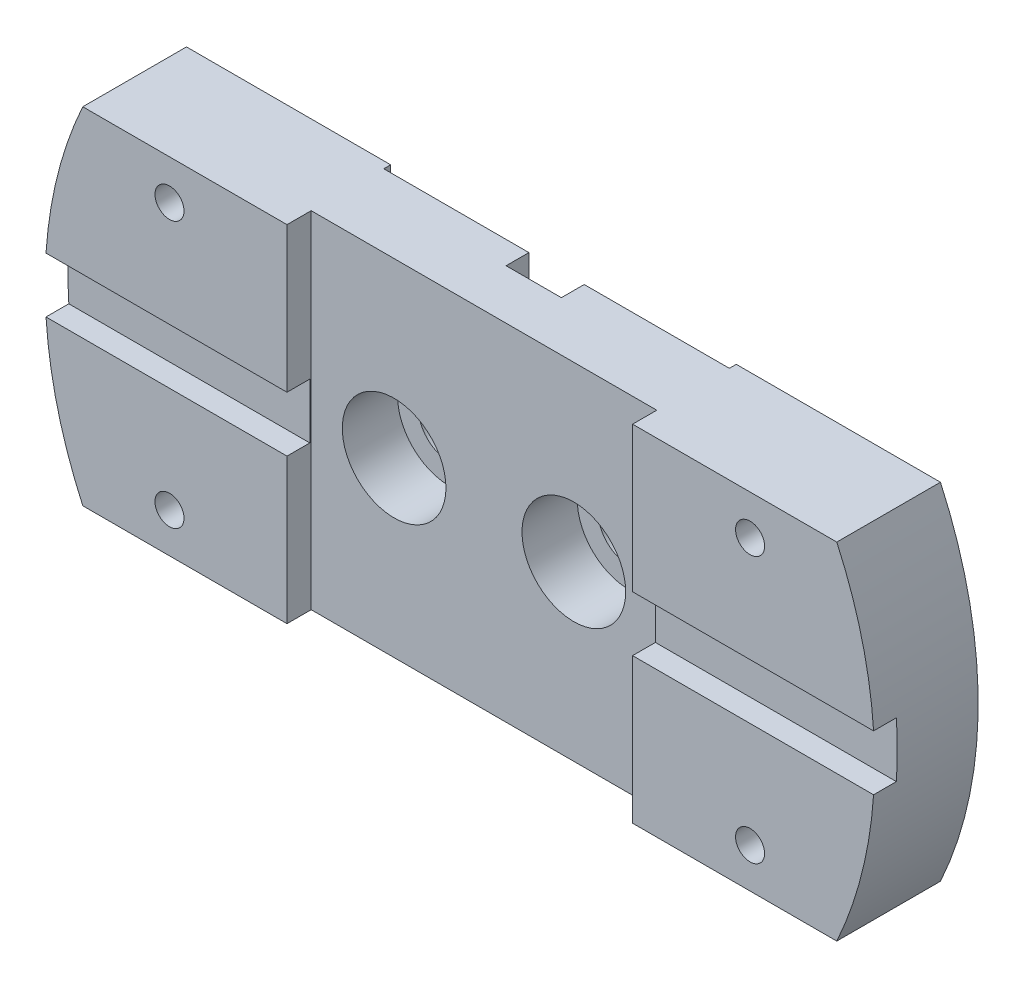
ISO-10303-21;
HEADER;
FILE_DESCRIPTION(('STEP AP214'),'2;1');
FILE_NAME('part.step','',(''),(''),'','','');
FILE_SCHEMA(('AUTOMOTIVE_DESIGN { 1 0 10303 214 1 1 1 1 }'));
ENDSEC;
DATA;
#1=APPLICATION_CONTEXT('core data for automotive mechanical design processes');
#2=APPLICATION_PROTOCOL_DEFINITION('international standard','automotive_design',2000,#1);
#3=PRODUCT_CONTEXT('',#1,'mechanical');
#4=PRODUCT('Part','Part','',(#3));
#5=PRODUCT_RELATED_PRODUCT_CATEGORY('part','',(#4));
#6=PRODUCT_DEFINITION_FORMATION('','',#4);
#7=PRODUCT_DEFINITION_CONTEXT('part definition',#1,'design');
#8=PRODUCT_DEFINITION('design','',#6,#7);
#9=PRODUCT_DEFINITION_SHAPE('','',#8);
#10=(LENGTH_UNIT() NAMED_UNIT(*) SI_UNIT(.MILLI.,.METRE.));
#11=(NAMED_UNIT(*) PLANE_ANGLE_UNIT() SI_UNIT($,.RADIAN.));
#12=(NAMED_UNIT(*) SI_UNIT($,.STERADIAN.) SOLID_ANGLE_UNIT());
#13=UNCERTAINTY_MEASURE_WITH_UNIT(LENGTH_MEASURE(1.E-05),#10,'distance_accuracy_value','');
#14=(GEOMETRIC_REPRESENTATION_CONTEXT(3) GLOBAL_UNCERTAINTY_ASSIGNED_CONTEXT((#13)) GLOBAL_UNIT_ASSIGNED_CONTEXT((#10,
#11,#12)) REPRESENTATION_CONTEXT('',''));
#15=CARTESIAN_POINT('',(0.,0.,0.));
#16=DIRECTION('',(0.,0.,1.));
#17=DIRECTION('',(1.,0.,0.));
#18=AXIS2_PLACEMENT_3D('',#15,#16,#17);
#19=CARTESIAN_POINT('',(0.,0.,15.));
#20=DIRECTION('',(0.,0.,1.));
#21=DIRECTION('',(1.,0.,0.));
#22=AXIS2_PLACEMENT_3D('',#19,#20,#21);
#23=PLANE('',#22);
#24=CARTESIAN_POINT('',(-42.,19.25,15.));
#25=DIRECTION('',(0.,0.,1.));
#26=DIRECTION('',(1.,0.,0.));
#27=AXIS2_PLACEMENT_3D('',#24,#25,#26);
#28=CIRCLE('',#27,2.09999999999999);
#29=CARTESIAN_POINT('',(-39.9,19.25,15.));
#30=VERTEX_POINT('',#29);
#31=EDGE_CURVE('E523',#30,#30,#28,.T.);
#32=ORIENTED_EDGE('',*,*,#31,.F.);
#33=EDGE_LOOP('',(#32));
#34=FACE_BOUND('',#33,.T.);
#35=DIRECTION('',(-1.,0.,0.));
#36=VECTOR('',#35,1.);
#37=CARTESIAN_POINT('',(0.,4.,15.));
#38=LINE('',#37,#36);
#39=CARTESIAN_POINT('',(-25.,4.,15.));
#40=VERTEX_POINT('',#39);
#41=CARTESIAN_POINT('',(-59.8665181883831,4.,15.));
#42=VERTEX_POINT('',#41);
#43=EDGE_CURVE('E232',#40,#42,#38,.T.);
#44=ORIENTED_EDGE('',*,*,#43,.F.);
#45=DIRECTION('',(0.,-1.,0.));
#46=VECTOR('',#45,1.);
#47=CARTESIAN_POINT('',(-25.,0.,15.));
#48=LINE('',#47,#46);
#49=CARTESIAN_POINT('',(-25.,25.,15.));
#50=VERTEX_POINT('',#49);
#51=EDGE_CURVE('E359',#50,#40,#48,.T.);
#52=ORIENTED_EDGE('',*,*,#51,.F.);
#53=DIRECTION('',(-1.,0.,0.));
#54=VECTOR('',#53,1.);
#55=CARTESIAN_POINT('',(-54.5435605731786,25.,15.));
#56=LINE('',#55,#54);
#57=CARTESIAN_POINT('',(-54.5435605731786,25.,15.));
#58=VERTEX_POINT('',#57);
#59=EDGE_CURVE('E324',#50,#58,#56,.T.);
#60=ORIENTED_EDGE('',*,*,#59,.T.);
#61=CARTESIAN_POINT('',(0.,0.,15.));
#62=DIRECTION('',(0.,0.,1.));
#63=DIRECTION('',(1.,0.,0.));
#64=AXIS2_PLACEMENT_3D('',#61,#62,#63);
#65=CIRCLE('',#64,60.);
#66=EDGE_CURVE('E313',#58,#42,#65,.T.);
#67=ORIENTED_EDGE('',*,*,#66,.T.);
#68=EDGE_LOOP('',(#44,#52,#60,#67));
#69=FACE_BOUND('',#68,.T.);
#70=ADVANCED_FACE('F32',(#34,#69),#23,.T.);
#71=CARTESIAN_POINT('',(42.,19.25,15.));
#72=DIRECTION('',(0.,0.,1.));
#73=DIRECTION('',(1.,0.,0.));
#74=AXIS2_PLACEMENT_3D('',#71,#72,#73);
#75=CIRCLE('',#74,2.09999999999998);
#76=CARTESIAN_POINT('',(44.1,19.25,15.));
#77=VERTEX_POINT('',#76);
#78=EDGE_CURVE('E529',#77,#77,#75,.T.);
#79=ORIENTED_EDGE('',*,*,#78,.F.);
#80=EDGE_LOOP('',(#79));
#81=FACE_BOUND('',#80,.T.);
#82=DIRECTION('',(-1.,0.,0.));
#83=VECTOR('',#82,1.);
#84=CARTESIAN_POINT('',(0.,4.,15.));
#85=LINE('',#84,#83);
#86=CARTESIAN_POINT('',(59.8665181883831,4.,15.));
#87=VERTEX_POINT('',#86);
#88=CARTESIAN_POINT('',(25.,4.,15.));
#89=VERTEX_POINT('',#88);
#90=EDGE_CURVE('E207',#87,#89,#85,.T.);
#91=ORIENTED_EDGE('',*,*,#90,.F.);
#92=CARTESIAN_POINT('',(0.,0.,15.));
#93=DIRECTION('',(0.,0.,1.));
#94=DIRECTION('',(1.,0.,0.));
#95=AXIS2_PLACEMENT_3D('',#92,#93,#94);
#96=CIRCLE('',#95,60.);
#97=CARTESIAN_POINT('',(54.5435605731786,25.,15.));
#98=VERTEX_POINT('',#97);
#99=EDGE_CURVE('E320',#87,#98,#96,.T.);
#100=ORIENTED_EDGE('',*,*,#99,.T.);
#101=CARTESIAN_POINT('',(25.,25.,15.));
#102=VERTEX_POINT('',#101);
#103=EDGE_CURVE('E325',#98,#102,#56,.T.);
#104=ORIENTED_EDGE('',*,*,#103,.T.);
#105=DIRECTION('',(0.,1.,0.));
#106=VECTOR('',#105,1.);
#107=CARTESIAN_POINT('',(25.,0.,15.));
#108=LINE('',#107,#106);
#109=EDGE_CURVE('E354',#89,#102,#108,.T.);
#110=ORIENTED_EDGE('',*,*,#109,.F.);
#111=EDGE_LOOP('',(#91,#100,#104,#110));
#112=FACE_BOUND('',#111,.T.);
#113=ADVANCED_FACE('F449',(#81,#112),#23,.T.);
#114=CARTESIAN_POINT('',(-42.,-19.25,15.));
#115=DIRECTION('',(0.,0.,1.));
#116=DIRECTION('',(1.,0.,0.));
#117=AXIS2_PLACEMENT_3D('',#114,#115,#116);
#118=CIRCLE('',#117,2.09999999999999);
#119=CARTESIAN_POINT('',(-39.9,-19.25,15.));
#120=VERTEX_POINT('',#119);
#121=EDGE_CURVE('E507',#120,#120,#118,.T.);
#122=ORIENTED_EDGE('',*,*,#121,.F.);
#123=EDGE_LOOP('',(#122));
#124=FACE_BOUND('',#123,.T.);
#125=DIRECTION('',(1.,0.,0.));
#126=VECTOR('',#125,1.);
#127=CARTESIAN_POINT('',(0.,-4.,15.));
#128=LINE('',#127,#126);
#129=CARTESIAN_POINT('',(-59.8665181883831,-4.,15.));
#130=VERTEX_POINT('',#129);
#131=CARTESIAN_POINT('',(-25.,-4.,15.));
#132=VERTEX_POINT('',#131);
#133=EDGE_CURVE('E49',#130,#132,#128,.T.);
#134=ORIENTED_EDGE('',*,*,#133,.F.);
#135=CARTESIAN_POINT('',(-54.5435605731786,-25.,15.));
#136=VERTEX_POINT('',#135);
#137=EDGE_CURVE('E217',#130,#136,#65,.T.);
#138=ORIENTED_EDGE('',*,*,#137,.T.);
#139=DIRECTION('',(1.,0.,0.));
#140=VECTOR('',#139,1.);
#141=CARTESIAN_POINT('',(-54.5435605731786,-25.,15.));
#142=LINE('',#141,#140);
#143=CARTESIAN_POINT('',(-25.,-25.,15.));
#144=VERTEX_POINT('',#143);
#145=EDGE_CURVE('E317',#136,#144,#142,.T.);
#146=ORIENTED_EDGE('',*,*,#145,.T.);
#147=EDGE_CURVE('E358',#132,#144,#48,.T.);
#148=ORIENTED_EDGE('',*,*,#147,.F.);
#149=EDGE_LOOP('',(#134,#138,#146,#148));
#150=FACE_BOUND('',#149,.T.);
#151=ADVANCED_FACE('F393',(#124,#150),#23,.T.);
#152=CARTESIAN_POINT('',(-25.,-25.,1.));
#153=DIRECTION('',(0.,0.,1.));
#154=DIRECTION('',(1.,0.,0.));
#155=AXIS2_PLACEMENT_3D('',#152,#153,#154);
#156=PLANE('',#155);
#157=CARTESIAN_POINT('',(13.,0.,1.));
#158=DIRECTION('',(0.,0.,1.));
#159=DIRECTION('',(1.,0.,0.));
#160=AXIS2_PLACEMENT_3D('',#157,#158,#159);
#161=CIRCLE('',#160,4.5);
#162=CARTESIAN_POINT('',(17.5,0.,1.));
#163=VERTEX_POINT('',#162);
#164=EDGE_CURVE('E36',#163,#163,#161,.T.);
#165=ORIENTED_EDGE('',*,*,#164,.T.);
#166=EDGE_LOOP('',(#165));
#167=FACE_BOUND('',#166,.T.);
#168=DIRECTION('',(1.,0.,0.));
#169=VECTOR('',#168,1.);
#170=CARTESIAN_POINT('',(-25.,-25.,1.));
#171=LINE('',#170,#169);
#172=CARTESIAN_POINT('',(4.,-25.,1.));
#173=VERTEX_POINT('',#172);
#174=CARTESIAN_POINT('',(25.,-25.,1.));
#175=VERTEX_POINT('',#174);
#176=EDGE_CURVE('E287',#173,#175,#171,.T.);
#177=ORIENTED_EDGE('',*,*,#176,.F.);
#178=DIRECTION('',(0.,1.,0.));
#179=VECTOR('',#178,1.);
#180=CARTESIAN_POINT('',(4.,-25.,1.));
#181=LINE('',#180,#179);
#182=CARTESIAN_POINT('',(4.,25.,1.));
#183=VERTEX_POINT('',#182);
#184=EDGE_CURVE('E349',#173,#183,#181,.T.);
#185=ORIENTED_EDGE('',*,*,#184,.T.);
#186=DIRECTION('',(1.,0.,0.));
#187=VECTOR('',#186,1.);
#188=CARTESIAN_POINT('',(-25.,25.,1.));
#189=LINE('',#188,#187);
#190=CARTESIAN_POINT('',(25.,25.,1.));
#191=VERTEX_POINT('',#190);
#192=EDGE_CURVE('E278',#183,#191,#189,.T.);
#193=ORIENTED_EDGE('',*,*,#192,.T.);
#194=DIRECTION('',(0.,1.,0.));
#195=VECTOR('',#194,1.);
#196=CARTESIAN_POINT('',(25.,-25.,1.));
#197=LINE('',#196,#195);
#198=EDGE_CURVE('E295',#175,#191,#197,.T.);
#199=ORIENTED_EDGE('',*,*,#198,.F.);
#200=EDGE_LOOP('',(#177,#185,#193,#199));
#201=FACE_BOUND('',#200,.T.);
#202=ADVANCED_FACE('F428',(#167,#201),#156,.F.);
#203=CARTESIAN_POINT('',(0.,0.,0.));
#204=DIRECTION('',(0.,0.,1.));
#205=DIRECTION('',(1.,0.,0.));
#206=AXIS2_PLACEMENT_3D('',#203,#204,#205);
#207=PLANE('',#206);
#208=CARTESIAN_POINT('',(-42.,-19.25,0.));
#209=DIRECTION('',(0.,0.,1.));
#210=DIRECTION('',(1.,0.,0.));
#211=AXIS2_PLACEMENT_3D('',#208,#209,#210);
#212=CIRCLE('',#211,2.1);
#213=CARTESIAN_POINT('',(-39.9,-19.25,0.));
#214=VERTEX_POINT('',#213);
#215=EDGE_CURVE('E510',#214,#214,#212,.T.);
#216=ORIENTED_EDGE('',*,*,#215,.T.);
#217=EDGE_LOOP('',(#216));
#218=FACE_BOUND('',#217,.T.);
#219=CARTESIAN_POINT('',(-42.,19.25,0.));
#220=DIRECTION('',(0.,0.,1.));
#221=DIRECTION('',(1.,0.,0.));
#222=AXIS2_PLACEMENT_3D('',#219,#220,#221);
#223=CIRCLE('',#222,2.1);
#224=CARTESIAN_POINT('',(-39.9,19.25,0.));
#225=VERTEX_POINT('',#224);
#226=EDGE_CURVE('E520',#225,#225,#223,.T.);
#227=ORIENTED_EDGE('',*,*,#226,.T.);
#228=EDGE_LOOP('',(#227));
#229=FACE_BOUND('',#228,.T.);
#230=DIRECTION('',(-1.,0.,0.));
#231=VECTOR('',#230,1.);
#232=CARTESIAN_POINT('',(-54.5435605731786,25.,0.));
#233=LINE('',#232,#231);
#234=CARTESIAN_POINT('',(-25.,25.,0.));
#235=VERTEX_POINT('',#234);
#236=CARTESIAN_POINT('',(-54.5435605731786,25.,0.));
#237=VERTEX_POINT('',#236);
#238=EDGE_CURVE('E309',#235,#237,#233,.T.);
#239=ORIENTED_EDGE('',*,*,#238,.F.);
#240=DIRECTION('',(0.,-1.,0.));
#241=VECTOR('',#240,1.);
#242=CARTESIAN_POINT('',(-25.,0.,0.));
#243=LINE('',#242,#241);
#244=CARTESIAN_POINT('',(-25.,-25.,0.));
#245=VERTEX_POINT('',#244);
#246=EDGE_CURVE('E343',#235,#245,#243,.T.);
#247=ORIENTED_EDGE('',*,*,#246,.T.);
#248=DIRECTION('',(1.,0.,0.));
#249=VECTOR('',#248,1.);
#250=CARTESIAN_POINT('',(-54.5435605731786,-25.,0.));
#251=LINE('',#250,#249);
#252=CARTESIAN_POINT('',(-54.5435605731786,-25.,0.));
#253=VERTEX_POINT('',#252);
#254=EDGE_CURVE('E304',#253,#245,#251,.T.);
#255=ORIENTED_EDGE('',*,*,#254,.F.);
#256=CARTESIAN_POINT('',(0.,0.,0.));
#257=DIRECTION('',(0.,0.,1.));
#258=DIRECTION('',(1.,0.,0.));
#259=AXIS2_PLACEMENT_3D('',#256,#257,#258);
#260=CIRCLE('',#259,60.);
#261=EDGE_CURVE('E298',#237,#253,#260,.T.);
#262=ORIENTED_EDGE('',*,*,#261,.F.);
#263=EDGE_LOOP('',(#239,#247,#255,#262));
#264=FACE_BOUND('',#263,.T.);
#265=ADVANCED_FACE('F403',(#218,#229,#264),#207,.F.);
#266=CARTESIAN_POINT('',(0.,0.,15.));
#267=DIRECTION('',(0.,0.,-1.));
#268=DIRECTION('',(-1.,0.,0.));
#269=AXIS2_PLACEMENT_3D('',#266,#267,#268);
#270=CYLINDRICAL_SURFACE('',#269,60.);
#271=CARTESIAN_POINT('',(0.,0.,11.7));
#272=DIRECTION('',(0.,0.,-1.));
#273=DIRECTION('',(-1.,0.,0.));
#274=AXIS2_PLACEMENT_3D('',#271,#272,#273);
#275=CIRCLE('',#274,60.);
#276=CARTESIAN_POINT('',(-59.8665181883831,-4.,11.7));
#277=VERTEX_POINT('',#276);
#278=CARTESIAN_POINT('',(-59.8665181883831,4.,11.7));
#279=VERTEX_POINT('',#278);
#280=EDGE_CURVE('E196',#277,#279,#275,.T.);
#281=ORIENTED_EDGE('',*,*,#280,.T.);
#282=DIRECTION('',(0.,0.,-1.));
#283=VECTOR('',#282,1.);
#284=CARTESIAN_POINT('',(-59.8665181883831,4.,15.));
#285=LINE('',#284,#283);
#286=EDGE_CURVE('E234',#279,#42,#285,.F.);
#287=ORIENTED_EDGE('',*,*,#286,.T.);
#288=ORIENTED_EDGE('',*,*,#66,.F.);
#289=DIRECTION('',(0.,0.,-1.));
#290=VECTOR('',#289,1.);
#291=CARTESIAN_POINT('',(-54.5435605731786,25.,15.));
#292=LINE('',#291,#290);
#293=EDGE_CURVE('E328',#58,#237,#292,.T.);
#294=ORIENTED_EDGE('',*,*,#293,.T.);
#295=ORIENTED_EDGE('',*,*,#261,.T.);
#296=DIRECTION('',(0.,0.,-1.));
#297=VECTOR('',#296,1.);
#298=CARTESIAN_POINT('',(-54.5435605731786,-25.,15.));
#299=LINE('',#298,#297);
#300=EDGE_CURVE('E337',#136,#253,#299,.T.);
#301=ORIENTED_EDGE('',*,*,#300,.F.);
#302=ORIENTED_EDGE('',*,*,#137,.F.);
#303=DIRECTION('',(0.,0.,-1.));
#304=VECTOR('',#303,1.);
#305=CARTESIAN_POINT('',(-59.8665181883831,-4.,15.));
#306=LINE('',#305,#304);
#307=EDGE_CURVE('E211',#130,#277,#306,.T.);
#308=ORIENTED_EDGE('',*,*,#307,.T.);
#309=EDGE_LOOP('',(#281,#287,#288,#294,#295,#301,#302,#308));
#310=FACE_BOUND('',#309,.T.);
#311=ADVANCED_FACE('F34',(#310),#270,.T.);
#312=CARTESIAN_POINT('',(-54.5435605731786,-25.,15.));
#313=DIRECTION('',(0.,1.,0.));
#314=DIRECTION('',(0.,0.,1.));
#315=AXIS2_PLACEMENT_3D('',#312,#313,#314);
#316=PLANE('',#315);
#317=DIRECTION('',(1.,0.,0.));
#318=VECTOR('',#317,1.);
#319=CARTESIAN_POINT('',(-54.5435605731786,-25.,11.5));
#320=LINE('',#319,#318);
#321=CARTESIAN_POINT('',(-25.,-25.,11.5));
#322=VERTEX_POINT('',#321);
#323=CARTESIAN_POINT('',(25.,-25.,11.5));
#324=VERTEX_POINT('',#323);
#325=EDGE_CURVE('E254',#322,#324,#320,.T.);
#326=ORIENTED_EDGE('',*,*,#325,.F.);
#327=DIRECTION('',(0.,0.,1.));
#328=VECTOR('',#327,1.);
#329=CARTESIAN_POINT('',(-25.,-25.,15.));
#330=LINE('',#329,#328);
#331=EDGE_CURVE('E251',#322,#144,#330,.T.);
#332=ORIENTED_EDGE('',*,*,#331,.T.);
#333=ORIENTED_EDGE('',*,*,#145,.F.);
#334=ORIENTED_EDGE('',*,*,#300,.T.);
#335=ORIENTED_EDGE('',*,*,#254,.T.);
#336=DIRECTION('',(0.,0.,1.));
#337=VECTOR('',#336,1.);
#338=CARTESIAN_POINT('',(-25.,-25.,-9.));
#339=LINE('',#338,#337);
#340=CARTESIAN_POINT('',(-25.,-25.,1.));
#341=VERTEX_POINT('',#340);
#342=EDGE_CURVE('E284',#245,#341,#339,.T.);
#343=ORIENTED_EDGE('',*,*,#342,.T.);
#344=CARTESIAN_POINT('',(-4.,-25.,1.));
#345=VERTEX_POINT('',#344);
#346=EDGE_CURVE('E288',#341,#345,#171,.T.);
#347=ORIENTED_EDGE('',*,*,#346,.T.);
#348=DIRECTION('',(0.,0.,1.));
#349=VECTOR('',#348,1.);
#350=CARTESIAN_POINT('',(-4.,-25.,15.));
#351=LINE('',#350,#349);
#352=CARTESIAN_POINT('',(-4.,-25.,4.3));
#353=VERTEX_POINT('',#352);
#354=EDGE_CURVE('E265',#345,#353,#351,.T.);
#355=ORIENTED_EDGE('',*,*,#354,.T.);
#356=DIRECTION('',(-1.,0.,0.));
#357=VECTOR('',#356,1.);
#358=CARTESIAN_POINT('',(-54.5435605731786,-25.,4.3));
#359=LINE('',#358,#357);
#360=CARTESIAN_POINT('',(4.,-25.,4.3));
#361=VERTEX_POINT('',#360);
#362=EDGE_CURVE('E274',#361,#353,#359,.T.);
#363=ORIENTED_EDGE('',*,*,#362,.F.);
#364=DIRECTION('',(0.,0.,-1.));
#365=VECTOR('',#364,1.);
#366=CARTESIAN_POINT('',(4.,-25.,15.));
#367=LINE('',#366,#365);
#368=EDGE_CURVE('E271',#361,#173,#367,.T.);
#369=ORIENTED_EDGE('',*,*,#368,.T.);
#370=ORIENTED_EDGE('',*,*,#176,.T.);
#371=DIRECTION('',(0.,0.,-1.));
#372=VECTOR('',#371,1.);
#373=CARTESIAN_POINT('',(25.,-25.,-9.));
#374=LINE('',#373,#372);
#375=CARTESIAN_POINT('',(25.,-25.,0.));
#376=VERTEX_POINT('',#375);
#377=EDGE_CURVE('E291',#175,#376,#374,.T.);
#378=ORIENTED_EDGE('',*,*,#377,.T.);
#379=CARTESIAN_POINT('',(54.5435605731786,-25.,0.));
#380=VERTEX_POINT('',#379);
#381=EDGE_CURVE('E303',#376,#380,#251,.T.);
#382=ORIENTED_EDGE('',*,*,#381,.T.);
#383=DIRECTION('',(0.,0.,-1.));
#384=VECTOR('',#383,1.);
#385=CARTESIAN_POINT('',(54.5435605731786,-25.,15.));
#386=LINE('',#385,#384);
#387=CARTESIAN_POINT('',(54.5435605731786,-25.,15.));
#388=VERTEX_POINT('',#387);
#389=EDGE_CURVE('E334',#388,#380,#386,.T.);
#390=ORIENTED_EDGE('',*,*,#389,.F.);
#391=CARTESIAN_POINT('',(25.,-25.,15.));
#392=VERTEX_POINT('',#391);
#393=EDGE_CURVE('E316',#392,#388,#142,.T.);
#394=ORIENTED_EDGE('',*,*,#393,.F.);
#395=DIRECTION('',(0.,0.,-1.));
#396=VECTOR('',#395,1.);
#397=CARTESIAN_POINT('',(25.,-25.,15.));
#398=LINE('',#397,#396);
#399=EDGE_CURVE('E245',#392,#324,#398,.T.);
#400=ORIENTED_EDGE('',*,*,#399,.T.);
#401=EDGE_LOOP('',(#326,#332,#333,#334,#335,#343,#347,#355,#363,#369,#370,#378,#382,#390,#394,#400));
#402=FACE_BOUND('',#401,.T.);
#403=ADVANCED_FACE('F397',(#402),#316,.F.);
#404=CARTESIAN_POINT('',(0.,0.,15.));
#405=DIRECTION('',(0.,0.,-1.));
#406=DIRECTION('',(-1.,0.,0.));
#407=AXIS2_PLACEMENT_3D('',#404,#405,#406);
#408=CYLINDRICAL_SURFACE('',#407,60.);
#409=ORIENTED_EDGE('',*,*,#99,.F.);
#410=DIRECTION('',(0.,0.,-1.));
#411=VECTOR('',#410,1.);
#412=CARTESIAN_POINT('',(59.8665181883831,4.,15.));
#413=LINE('',#412,#411);
#414=CARTESIAN_POINT('',(59.8665181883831,4.,11.7));
#415=VERTEX_POINT('',#414);
#416=EDGE_CURVE('E226',#87,#415,#413,.T.);
#417=ORIENTED_EDGE('',*,*,#416,.T.);
#418=CARTESIAN_POINT('',(0.,0.,11.7));
#419=DIRECTION('',(0.,0.,-1.));
#420=DIRECTION('',(-1.,0.,0.));
#421=AXIS2_PLACEMENT_3D('',#418,#419,#420);
#422=CIRCLE('',#421,60.);
#423=CARTESIAN_POINT('',(59.8665181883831,-4.,11.7));
#424=VERTEX_POINT('',#423);
#425=EDGE_CURVE('E208',#415,#424,#422,.T.);
#426=ORIENTED_EDGE('',*,*,#425,.T.);
#427=DIRECTION('',(0.,0.,-1.));
#428=VECTOR('',#427,1.);
#429=CARTESIAN_POINT('',(59.8665181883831,-4.,15.));
#430=LINE('',#429,#428);
#431=CARTESIAN_POINT('',(59.8665181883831,-4.,15.));
#432=VERTEX_POINT('',#431);
#433=EDGE_CURVE('E387',#424,#432,#430,.F.);
#434=ORIENTED_EDGE('',*,*,#433,.T.);
#435=EDGE_CURVE('E321',#388,#432,#96,.T.);
#436=ORIENTED_EDGE('',*,*,#435,.F.);
#437=ORIENTED_EDGE('',*,*,#389,.T.);
#438=CARTESIAN_POINT('',(0.,0.,0.));
#439=DIRECTION('',(0.,0.,1.));
#440=DIRECTION('',(1.,0.,0.));
#441=AXIS2_PLACEMENT_3D('',#438,#439,#440);
#442=CIRCLE('',#441,60.);
#443=CARTESIAN_POINT('',(54.5435605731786,25.,0.));
#444=VERTEX_POINT('',#443);
#445=EDGE_CURVE('E307',#380,#444,#442,.T.);
#446=ORIENTED_EDGE('',*,*,#445,.T.);
#447=DIRECTION('',(0.,0.,-1.));
#448=VECTOR('',#447,1.);
#449=CARTESIAN_POINT('',(54.5435605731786,25.,15.));
#450=LINE('',#449,#448);
#451=EDGE_CURVE('E331',#98,#444,#450,.T.);
#452=ORIENTED_EDGE('',*,*,#451,.F.);
#453=EDGE_LOOP('',(#409,#417,#426,#434,#436,#437,#446,#452));
#454=FACE_BOUND('',#453,.T.);
#455=ADVANCED_FACE('F442',(#454),#408,.T.);
#456=CARTESIAN_POINT('',(-54.5435605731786,25.,15.));
#457=DIRECTION('',(0.,-1.,0.));
#458=DIRECTION('',(0.,0.,-1.));
#459=AXIS2_PLACEMENT_3D('',#456,#457,#458);
#460=PLANE('',#459);
#461=ORIENTED_EDGE('',*,*,#59,.F.);
#462=DIRECTION('',(0.,0.,-1.));
#463=VECTOR('',#462,1.);
#464=CARTESIAN_POINT('',(-25.,25.,15.));
#465=LINE('',#464,#463);
#466=CARTESIAN_POINT('',(-25.,25.,11.5));
#467=VERTEX_POINT('',#466);
#468=EDGE_CURVE('E248',#50,#467,#465,.T.);
#469=ORIENTED_EDGE('',*,*,#468,.T.);
#470=DIRECTION('',(-1.,0.,0.));
#471=VECTOR('',#470,1.);
#472=CARTESIAN_POINT('',(-54.5435605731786,25.,11.5));
#473=LINE('',#472,#471);
#474=CARTESIAN_POINT('',(25.,25.,11.5));
#475=VERTEX_POINT('',#474);
#476=EDGE_CURVE('E362',#475,#467,#473,.T.);
#477=ORIENTED_EDGE('',*,*,#476,.F.);
#478=DIRECTION('',(0.,0.,1.));
#479=VECTOR('',#478,1.);
#480=CARTESIAN_POINT('',(25.,25.,15.));
#481=LINE('',#480,#479);
#482=EDGE_CURVE('E242',#475,#102,#481,.T.);
#483=ORIENTED_EDGE('',*,*,#482,.T.);
#484=ORIENTED_EDGE('',*,*,#103,.F.);
#485=ORIENTED_EDGE('',*,*,#451,.T.);
#486=CARTESIAN_POINT('',(25.,25.,0.));
#487=VERTEX_POINT('',#486);
#488=EDGE_CURVE('E310',#444,#487,#233,.T.);
#489=ORIENTED_EDGE('',*,*,#488,.T.);
#490=DIRECTION('',(0.,0.,-1.));
#491=VECTOR('',#490,1.);
#492=CARTESIAN_POINT('',(25.,25.,-9.));
#493=LINE('',#492,#491);
#494=EDGE_CURVE('E282',#191,#487,#493,.T.);
#495=ORIENTED_EDGE('',*,*,#494,.F.);
#496=ORIENTED_EDGE('',*,*,#192,.F.);
#497=DIRECTION('',(0.,0.,1.));
#498=VECTOR('',#497,1.);
#499=CARTESIAN_POINT('',(4.,25.,15.));
#500=LINE('',#499,#498);
#501=CARTESIAN_POINT('',(4.,25.,4.3));
#502=VERTEX_POINT('',#501);
#503=EDGE_CURVE('E268',#183,#502,#500,.T.);
#504=ORIENTED_EDGE('',*,*,#503,.T.);
#505=DIRECTION('',(1.,0.,0.));
#506=VECTOR('',#505,1.);
#507=CARTESIAN_POINT('',(-54.5435605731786,25.,4.3));
#508=LINE('',#507,#506);
#509=CARTESIAN_POINT('',(-4.,25.,4.3));
#510=VERTEX_POINT('',#509);
#511=EDGE_CURVE('E352',#510,#502,#508,.T.);
#512=ORIENTED_EDGE('',*,*,#511,.F.);
#513=DIRECTION('',(0.,0.,-1.));
#514=VECTOR('',#513,1.);
#515=CARTESIAN_POINT('',(-4.,25.,15.));
#516=LINE('',#515,#514);
#517=CARTESIAN_POINT('',(-4.,25.,1.));
#518=VERTEX_POINT('',#517);
#519=EDGE_CURVE('E262',#510,#518,#516,.T.);
#520=ORIENTED_EDGE('',*,*,#519,.T.);
#521=CARTESIAN_POINT('',(-25.,25.,1.));
#522=VERTEX_POINT('',#521);
#523=EDGE_CURVE('E279',#522,#518,#189,.T.);
#524=ORIENTED_EDGE('',*,*,#523,.F.);
#525=DIRECTION('',(0.,0.,1.));
#526=VECTOR('',#525,1.);
#527=CARTESIAN_POINT('',(-25.,25.,-9.));
#528=LINE('',#527,#526);
#529=EDGE_CURVE('E276',#235,#522,#528,.T.);
#530=ORIENTED_EDGE('',*,*,#529,.F.);
#531=ORIENTED_EDGE('',*,*,#238,.T.);
#532=ORIENTED_EDGE('',*,*,#293,.F.);
#533=EDGE_LOOP('',(#461,#469,#477,#483,#484,#485,#489,#495,#496,#504,#512,#520,#524,#530,#531,#532));
#534=FACE_BOUND('',#533,.T.);
#535=ADVANCED_FACE('F417',(#534),#460,.F.);
#536=CARTESIAN_POINT('',(42.,-19.25,15.));
#537=DIRECTION('',(0.,0.,1.));
#538=DIRECTION('',(1.,0.,0.));
#539=AXIS2_PLACEMENT_3D('',#536,#537,#538);
#540=CIRCLE('',#539,2.09999999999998);
#541=CARTESIAN_POINT('',(44.1,-19.25,15.));
#542=VERTEX_POINT('',#541);
#543=EDGE_CURVE('E513',#542,#542,#540,.T.);
#544=ORIENTED_EDGE('',*,*,#543,.F.);
#545=EDGE_LOOP('',(#544));
#546=FACE_BOUND('',#545,.T.);
#547=DIRECTION('',(1.,0.,0.));
#548=VECTOR('',#547,1.);
#549=CARTESIAN_POINT('',(0.,-4.,15.));
#550=LINE('',#549,#548);
#551=CARTESIAN_POINT('',(25.,-4.,15.));
#552=VERTEX_POINT('',#551);
#553=EDGE_CURVE('E385',#552,#432,#550,.T.);
#554=ORIENTED_EDGE('',*,*,#553,.F.);
#555=EDGE_CURVE('E355',#392,#552,#108,.T.);
#556=ORIENTED_EDGE('',*,*,#555,.F.);
#557=ORIENTED_EDGE('',*,*,#393,.T.);
#558=ORIENTED_EDGE('',*,*,#435,.T.);
#559=EDGE_LOOP('',(#554,#556,#557,#558));
#560=FACE_BOUND('',#559,.T.);
#561=ADVANCED_FACE('F461',(#546,#560),#23,.T.);
#562=CARTESIAN_POINT('',(42.,-19.25,0.));
#563=DIRECTION('',(0.,0.,1.));
#564=DIRECTION('',(1.,0.,0.));
#565=AXIS2_PLACEMENT_3D('',#562,#563,#564);
#566=CIRCLE('',#565,2.1);
#567=CARTESIAN_POINT('',(44.1,-19.25,0.));
#568=VERTEX_POINT('',#567);
#569=EDGE_CURVE('E509',#568,#568,#566,.T.);
#570=ORIENTED_EDGE('',*,*,#569,.T.);
#571=EDGE_LOOP('',(#570));
#572=FACE_BOUND('',#571,.T.);
#573=CARTESIAN_POINT('',(42.,19.25,0.));
#574=DIRECTION('',(0.,0.,1.));
#575=DIRECTION('',(1.,0.,0.));
#576=AXIS2_PLACEMENT_3D('',#573,#574,#575);
#577=CIRCLE('',#576,2.1);
#578=CARTESIAN_POINT('',(44.1,19.25,0.));
#579=VERTEX_POINT('',#578);
#580=EDGE_CURVE('E526',#579,#579,#577,.T.);
#581=ORIENTED_EDGE('',*,*,#580,.T.);
#582=EDGE_LOOP('',(#581));
#583=FACE_BOUND('',#582,.T.);
#584=ORIENTED_EDGE('',*,*,#381,.F.);
#585=DIRECTION('',(0.,1.,0.));
#586=VECTOR('',#585,1.);
#587=CARTESIAN_POINT('',(25.,0.,0.));
#588=LINE('',#587,#586);
#589=EDGE_CURVE('E340',#376,#487,#588,.T.);
#590=ORIENTED_EDGE('',*,*,#589,.T.);
#591=ORIENTED_EDGE('',*,*,#488,.F.);
#592=ORIENTED_EDGE('',*,*,#445,.F.);
#593=EDGE_LOOP('',(#584,#590,#591,#592));
#594=FACE_BOUND('',#593,.T.);
#595=ADVANCED_FACE('F437',(#572,#583,#594),#207,.F.);
#596=CARTESIAN_POINT('',(-25.,-25.,-9.));
#597=DIRECTION('',(-1.,0.,0.));
#598=DIRECTION('',(0.,0.,1.));
#599=AXIS2_PLACEMENT_3D('',#596,#597,#598);
#600=PLANE('',#599);
#601=ORIENTED_EDGE('',*,*,#529,.T.);
#602=DIRECTION('',(0.,1.,0.));
#603=VECTOR('',#602,1.);
#604=CARTESIAN_POINT('',(-25.,-25.,1.));
#605=LINE('',#604,#603);
#606=EDGE_CURVE('E294',#341,#522,#605,.T.);
#607=ORIENTED_EDGE('',*,*,#606,.F.);
#608=ORIENTED_EDGE('',*,*,#342,.F.);
#609=ORIENTED_EDGE('',*,*,#246,.F.);
#610=EDGE_LOOP('',(#601,#607,#608,#609));
#611=FACE_BOUND('',#610,.T.);
#612=ADVANCED_FACE('F406',(#611),#600,.F.);
#613=CARTESIAN_POINT('',(25.,-25.,-9.));
#614=DIRECTION('',(1.,0.,0.));
#615=DIRECTION('',(0.,0.,-1.));
#616=AXIS2_PLACEMENT_3D('',#613,#614,#615);
#617=PLANE('',#616);
#618=ORIENTED_EDGE('',*,*,#377,.F.);
#619=ORIENTED_EDGE('',*,*,#198,.T.);
#620=ORIENTED_EDGE('',*,*,#494,.T.);
#621=ORIENTED_EDGE('',*,*,#589,.F.);
#622=EDGE_LOOP('',(#618,#619,#620,#621));
#623=FACE_BOUND('',#622,.T.);
#624=ADVANCED_FACE('F432',(#623),#617,.F.);
#625=CARTESIAN_POINT('',(-13.,0.,1.));
#626=DIRECTION('',(0.,0.,1.));
#627=DIRECTION('',(1.,0.,0.));
#628=AXIS2_PLACEMENT_3D('',#625,#626,#627);
#629=CIRCLE('',#628,4.5);
#630=CARTESIAN_POINT('',(-8.5,0.,1.));
#631=VERTEX_POINT('',#630);
#632=EDGE_CURVE('E368',#631,#631,#629,.T.);
#633=ORIENTED_EDGE('',*,*,#632,.T.);
#634=EDGE_LOOP('',(#633));
#635=FACE_BOUND('',#634,.T.);
#636=ORIENTED_EDGE('',*,*,#523,.T.);
#637=DIRECTION('',(0.,-1.,0.));
#638=VECTOR('',#637,1.);
#639=CARTESIAN_POINT('',(-4.,-25.,1.));
#640=LINE('',#639,#638);
#641=EDGE_CURVE('E346',#518,#345,#640,.T.);
#642=ORIENTED_EDGE('',*,*,#641,.T.);
#643=ORIENTED_EDGE('',*,*,#346,.F.);
#644=ORIENTED_EDGE('',*,*,#606,.T.);
#645=EDGE_LOOP('',(#636,#642,#643,#644));
#646=FACE_BOUND('',#645,.T.);
#647=ADVANCED_FACE('F410',(#635,#646),#156,.F.);
#648=CARTESIAN_POINT('',(4.,-30.,4.3));
#649=DIRECTION('',(0.,0.,-1.));
#650=DIRECTION('',(-1.,0.,0.));
#651=AXIS2_PLACEMENT_3D('',#648,#649,#650);
#652=PLANE('',#651);
#653=ORIENTED_EDGE('',*,*,#362,.T.);
#654=DIRECTION('',(0.,1.,0.));
#655=VECTOR('',#654,1.);
#656=CARTESIAN_POINT('',(-4.,30.,4.3));
#657=LINE('',#656,#655);
#658=EDGE_CURVE('E259',#353,#510,#657,.T.);
#659=ORIENTED_EDGE('',*,*,#658,.T.);
#660=ORIENTED_EDGE('',*,*,#511,.T.);
#661=DIRECTION('',(0.,-1.,0.));
#662=VECTOR('',#661,1.);
#663=CARTESIAN_POINT('',(4.,30.,4.3));
#664=LINE('',#663,#662);
#665=EDGE_CURVE('E256',#502,#361,#664,.T.);
#666=ORIENTED_EDGE('',*,*,#665,.T.);
#667=EDGE_LOOP('',(#653,#659,#660,#666));
#668=FACE_BOUND('',#667,.T.);
#669=ADVANCED_FACE('F421',(#668),#652,.T.);
#670=CARTESIAN_POINT('',(4.,30.,4.3));
#671=DIRECTION('',(1.,0.,0.));
#672=DIRECTION('',(0.,1.,0.));
#673=AXIS2_PLACEMENT_3D('',#670,#671,#672);
#674=PLANE('',#673);
#675=ORIENTED_EDGE('',*,*,#665,.F.);
#676=ORIENTED_EDGE('',*,*,#503,.F.);
#677=ORIENTED_EDGE('',*,*,#184,.F.);
#678=ORIENTED_EDGE('',*,*,#368,.F.);
#679=EDGE_LOOP('',(#675,#676,#677,#678));
#680=FACE_BOUND('',#679,.T.);
#681=ADVANCED_FACE('F424',(#680),#674,.F.);
#682=CARTESIAN_POINT('',(-4.,30.,4.3));
#683=DIRECTION('',(-1.,0.,0.));
#684=DIRECTION('',(0.,-1.,0.));
#685=AXIS2_PLACEMENT_3D('',#682,#683,#684);
#686=PLANE('',#685);
#687=ORIENTED_EDGE('',*,*,#641,.F.);
#688=ORIENTED_EDGE('',*,*,#519,.F.);
#689=ORIENTED_EDGE('',*,*,#658,.F.);
#690=ORIENTED_EDGE('',*,*,#354,.F.);
#691=EDGE_LOOP('',(#687,#688,#689,#690));
#692=FACE_BOUND('',#691,.T.);
#693=ADVANCED_FACE('F412',(#692),#686,.F.);
#694=CARTESIAN_POINT('',(-25.,-30.,11.5));
#695=DIRECTION('',(0.,0.,1.));
#696=DIRECTION('',(1.,0.,0.));
#697=AXIS2_PLACEMENT_3D('',#694,#695,#696);
#698=PLANE('',#697);
#699=CARTESIAN_POINT('',(13.,0.,11.5));
#700=DIRECTION('',(0.,0.,1.));
#701=DIRECTION('',(1.,0.,0.));
#702=AXIS2_PLACEMENT_3D('',#699,#700,#701);
#703=CIRCLE('',#702,7.5);
#704=CARTESIAN_POINT('',(20.5,0.,11.5));
#705=VERTEX_POINT('',#704);
#706=EDGE_CURVE('E538',#705,#705,#703,.T.);
#707=ORIENTED_EDGE('',*,*,#706,.F.);
#708=EDGE_LOOP('',(#707));
#709=FACE_BOUND('',#708,.T.);
#710=CARTESIAN_POINT('',(-13.,0.,11.5));
#711=DIRECTION('',(0.,0.,1.));
#712=DIRECTION('',(1.,0.,0.));
#713=AXIS2_PLACEMENT_3D('',#710,#711,#712);
#714=CIRCLE('',#713,7.5);
#715=CARTESIAN_POINT('',(-5.5,0.,11.5));
#716=VERTEX_POINT('',#715);
#717=EDGE_CURVE('E370',#716,#716,#714,.T.);
#718=ORIENTED_EDGE('',*,*,#717,.F.);
#719=EDGE_LOOP('',(#718));
#720=FACE_BOUND('',#719,.T.);
#721=ORIENTED_EDGE('',*,*,#325,.T.);
#722=DIRECTION('',(0.,1.,0.));
#723=VECTOR('',#722,1.);
#724=CARTESIAN_POINT('',(25.,30.,11.5));
#725=LINE('',#724,#723);
#726=EDGE_CURVE('E239',#324,#475,#725,.T.);
#727=ORIENTED_EDGE('',*,*,#726,.T.);
#728=ORIENTED_EDGE('',*,*,#476,.T.);
#729=DIRECTION('',(0.,-1.,0.));
#730=VECTOR('',#729,1.);
#731=CARTESIAN_POINT('',(-25.,30.,11.5));
#732=LINE('',#731,#730);
#733=EDGE_CURVE('E236',#467,#322,#732,.T.);
#734=ORIENTED_EDGE('',*,*,#733,.T.);
#735=EDGE_LOOP('',(#721,#727,#728,#734));
#736=FACE_BOUND('',#735,.T.);
#737=ADVANCED_FACE('F465',(#709,#720,#736),#698,.T.);
#738=CARTESIAN_POINT('',(-25.,30.,11.5));
#739=DIRECTION('',(-1.,0.,0.));
#740=DIRECTION('',(0.,-1.,0.));
#741=AXIS2_PLACEMENT_3D('',#738,#739,#740);
#742=PLANE('',#741);
#743=ORIENTED_EDGE('',*,*,#51,.T.);
#744=DIRECTION('',(0.,0.,-1.));
#745=VECTOR('',#744,1.);
#746=CARTESIAN_POINT('',(-25.,4.,11.5));
#747=LINE('',#746,#745);
#748=CARTESIAN_POINT('',(-25.,4.,11.7));
#749=VERTEX_POINT('',#748);
#750=EDGE_CURVE('E229',#40,#749,#747,.T.);
#751=ORIENTED_EDGE('',*,*,#750,.T.);
#752=DIRECTION('',(0.,-1.,0.));
#753=VECTOR('',#752,1.);
#754=CARTESIAN_POINT('',(-25.,30.,11.7));
#755=LINE('',#754,#753);
#756=CARTESIAN_POINT('',(-25.,-4.,11.7));
#757=VERTEX_POINT('',#756);
#758=EDGE_CURVE('E218',#749,#757,#755,.T.);
#759=ORIENTED_EDGE('',*,*,#758,.T.);
#760=DIRECTION('',(0.,0.,1.));
#761=VECTOR('',#760,1.);
#762=CARTESIAN_POINT('',(-25.,-4.,11.5));
#763=LINE('',#762,#761);
#764=EDGE_CURVE('E212',#757,#132,#763,.T.);
#765=ORIENTED_EDGE('',*,*,#764,.T.);
#766=ORIENTED_EDGE('',*,*,#147,.T.);
#767=ORIENTED_EDGE('',*,*,#331,.F.);
#768=ORIENTED_EDGE('',*,*,#733,.F.);
#769=ORIENTED_EDGE('',*,*,#468,.F.);
#770=EDGE_LOOP('',(#743,#751,#759,#765,#766,#767,#768,#769));
#771=FACE_BOUND('',#770,.T.);
#772=ADVANCED_FACE('F391',(#771),#742,.F.);
#773=CARTESIAN_POINT('',(25.,30.,11.5));
#774=DIRECTION('',(1.,0.,0.));
#775=DIRECTION('',(0.,1.,0.));
#776=AXIS2_PLACEMENT_3D('',#773,#774,#775);
#777=PLANE('',#776);
#778=DIRECTION('',(0.,1.,0.));
#779=VECTOR('',#778,1.);
#780=CARTESIAN_POINT('',(25.,30.,11.7));
#781=LINE('',#780,#779);
#782=CARTESIAN_POINT('',(25.,-4.,11.7));
#783=VERTEX_POINT('',#782);
#784=CARTESIAN_POINT('',(25.,4.,11.7));
#785=VERTEX_POINT('',#784);
#786=EDGE_CURVE('E41',#783,#785,#781,.T.);
#787=ORIENTED_EDGE('',*,*,#786,.T.);
#788=DIRECTION('',(0.,0.,1.));
#789=VECTOR('',#788,1.);
#790=CARTESIAN_POINT('',(25.,4.,11.5));
#791=LINE('',#790,#789);
#792=EDGE_CURVE('E11',#785,#89,#791,.T.);
#793=ORIENTED_EDGE('',*,*,#792,.T.);
#794=ORIENTED_EDGE('',*,*,#109,.T.);
#795=ORIENTED_EDGE('',*,*,#482,.F.);
#796=ORIENTED_EDGE('',*,*,#726,.F.);
#797=ORIENTED_EDGE('',*,*,#399,.F.);
#798=ORIENTED_EDGE('',*,*,#555,.T.);
#799=DIRECTION('',(0.,0.,-1.));
#800=VECTOR('',#799,1.);
#801=CARTESIAN_POINT('',(25.,-4.,11.5));
#802=LINE('',#801,#800);
#803=EDGE_CURVE('E364',#552,#783,#802,.T.);
#804=ORIENTED_EDGE('',*,*,#803,.T.);
#805=EDGE_LOOP('',(#787,#793,#794,#795,#796,#797,#798,#804));
#806=FACE_BOUND('',#805,.T.);
#807=ADVANCED_FACE('F456',(#806),#777,.F.);
#808=CARTESIAN_POINT('',(-60.,-4.,21.7));
#809=DIRECTION('',(0.,-1.,0.));
#810=DIRECTION('',(0.,0.,-1.));
#811=AXIS2_PLACEMENT_3D('',#808,#809,#810);
#812=PLANE('',#811);
#813=DIRECTION('',(1.,0.,0.));
#814=VECTOR('',#813,1.);
#815=CARTESIAN_POINT('',(-60.,-4.,11.7));
#816=LINE('',#815,#814);
#817=EDGE_CURVE('E57',#783,#424,#816,.T.);
#818=ORIENTED_EDGE('',*,*,#817,.F.);
#819=ORIENTED_EDGE('',*,*,#803,.F.);
#820=ORIENTED_EDGE('',*,*,#553,.T.);
#821=ORIENTED_EDGE('',*,*,#433,.F.);
#822=EDGE_LOOP('',(#818,#819,#820,#821));
#823=FACE_BOUND('',#822,.T.);
#824=ADVANCED_FACE('F459',(#823),#812,.F.);
#825=CARTESIAN_POINT('',(-60.,4.,11.7));
#826=DIRECTION('',(0.,0.,-1.));
#827=DIRECTION('',(-1.,0.,0.));
#828=AXIS2_PLACEMENT_3D('',#825,#826,#827);
#829=PLANE('',#828);
#830=DIRECTION('',(1.,0.,0.));
#831=VECTOR('',#830,1.);
#832=CARTESIAN_POINT('',(-60.,4.,11.7));
#833=LINE('',#832,#831);
#834=EDGE_CURVE('E213',#785,#415,#833,.T.);
#835=ORIENTED_EDGE('',*,*,#834,.F.);
#836=ORIENTED_EDGE('',*,*,#786,.F.);
#837=ORIENTED_EDGE('',*,*,#817,.T.);
#838=ORIENTED_EDGE('',*,*,#425,.F.);
#839=EDGE_LOOP('',(#835,#836,#837,#838));
#840=FACE_BOUND('',#839,.T.);
#841=ADVANCED_FACE('F454',(#840),#829,.F.);
#842=CARTESIAN_POINT('',(-60.,4.,21.7));
#843=DIRECTION('',(0.,1.,0.));
#844=DIRECTION('',(0.,0.,1.));
#845=AXIS2_PLACEMENT_3D('',#842,#843,#844);
#846=PLANE('',#845);
#847=ORIENTED_EDGE('',*,*,#90,.T.);
#848=ORIENTED_EDGE('',*,*,#792,.F.);
#849=ORIENTED_EDGE('',*,*,#834,.T.);
#850=ORIENTED_EDGE('',*,*,#416,.F.);
#851=EDGE_LOOP('',(#847,#848,#849,#850));
#852=FACE_BOUND('',#851,.T.);
#853=ADVANCED_FACE('F451',(#852),#846,.F.);
#854=EDGE_CURVE('E202',#279,#749,#833,.T.);
#855=ORIENTED_EDGE('',*,*,#854,.T.);
#856=ORIENTED_EDGE('',*,*,#750,.F.);
#857=ORIENTED_EDGE('',*,*,#43,.T.);
#858=ORIENTED_EDGE('',*,*,#286,.F.);
#859=EDGE_LOOP('',(#855,#856,#857,#858));
#860=FACE_BOUND('',#859,.T.);
#861=ADVANCED_FACE('F471',(#860),#846,.F.);
#862=ORIENTED_EDGE('',*,*,#280,.F.);
#863=EDGE_CURVE('E199',#277,#757,#816,.T.);
#864=ORIENTED_EDGE('',*,*,#863,.T.);
#865=ORIENTED_EDGE('',*,*,#758,.F.);
#866=ORIENTED_EDGE('',*,*,#854,.F.);
#867=EDGE_LOOP('',(#862,#864,#865,#866));
#868=FACE_BOUND('',#867,.T.);
#869=ADVANCED_FACE('F198',(#868),#829,.F.);
#870=ORIENTED_EDGE('',*,*,#133,.T.);
#871=ORIENTED_EDGE('',*,*,#764,.F.);
#872=ORIENTED_EDGE('',*,*,#863,.F.);
#873=ORIENTED_EDGE('',*,*,#307,.F.);
#874=EDGE_LOOP('',(#870,#871,#872,#873));
#875=FACE_BOUND('',#874,.T.);
#876=ADVANCED_FACE('F210',(#875),#812,.F.);
#877=CARTESIAN_POINT('',(-13.,0.,11.5));
#878=DIRECTION('',(0.,0.,1.));
#879=DIRECTION('',(1.,0.,0.));
#880=AXIS2_PLACEMENT_3D('',#877,#878,#879);
#881=CYLINDRICAL_SURFACE('',#880,4.5);
#882=CARTESIAN_POINT('',(-13.,0.,3.5));
#883=DIRECTION('',(0.,0.,1.));
#884=DIRECTION('',(1.,0.,0.));
#885=AXIS2_PLACEMENT_3D('',#882,#883,#884);
#886=CIRCLE('',#885,4.5);
#887=CARTESIAN_POINT('',(-8.5,0.,3.5));
#888=VERTEX_POINT('',#887);
#889=EDGE_CURVE('E379',#888,#888,#886,.T.);
#890=ORIENTED_EDGE('',*,*,#889,.T.);
#891=EDGE_LOOP('',(#890));
#892=FACE_BOUND('',#891,.T.);
#893=ORIENTED_EDGE('',*,*,#632,.F.);
#894=EDGE_LOOP('',(#893));
#895=FACE_BOUND('',#894,.T.);
#896=ADVANCED_FACE('F569',(#892,#895),#881,.F.);
#897=CARTESIAN_POINT('',(-13.,0.,11.5));
#898=DIRECTION('',(0.,0.,1.));
#899=DIRECTION('',(1.,0.,0.));
#900=AXIS2_PLACEMENT_3D('',#897,#898,#899);
#901=CYLINDRICAL_SURFACE('',#900,7.5);
#902=CARTESIAN_POINT('',(-13.,0.,3.5));
#903=DIRECTION('',(0.,0.,1.));
#904=DIRECTION('',(1.,0.,0.));
#905=AXIS2_PLACEMENT_3D('',#902,#903,#904);
#906=CIRCLE('',#905,7.5);
#907=CARTESIAN_POINT('',(-5.5,0.,3.5));
#908=VERTEX_POINT('',#907);
#909=EDGE_CURVE('E374',#908,#908,#906,.T.);
#910=ORIENTED_EDGE('',*,*,#909,.F.);
#911=EDGE_LOOP('',(#910));
#912=FACE_BOUND('',#911,.T.);
#913=ORIENTED_EDGE('',*,*,#717,.T.);
#914=EDGE_LOOP('',(#913));
#915=FACE_BOUND('',#914,.T.);
#916=ADVANCED_FACE('F559',(#912,#915),#901,.F.);
#917=CARTESIAN_POINT('',(-8.5,0.,3.5));
#918=DIRECTION('',(0.,0.,-1.));
#919=DIRECTION('',(-1.,0.,0.));
#920=AXIS2_PLACEMENT_3D('',#917,#918,#919);
#921=PLANE('',#920);
#922=ORIENTED_EDGE('',*,*,#889,.F.);
#923=EDGE_LOOP('',(#922));
#924=FACE_BOUND('',#923,.T.);
#925=ORIENTED_EDGE('',*,*,#909,.T.);
#926=EDGE_LOOP('',(#925));
#927=FACE_BOUND('',#926,.T.);
#928=ADVANCED_FACE('F549',(#924,#927),#921,.F.);
#929=CARTESIAN_POINT('',(13.,0.,11.5));
#930=DIRECTION('',(0.,0.,1.));
#931=DIRECTION('',(1.,0.,0.));
#932=AXIS2_PLACEMENT_3D('',#929,#930,#931);
#933=CYLINDRICAL_SURFACE('',#932,4.5);
#934=CARTESIAN_POINT('',(13.,0.,3.5));
#935=DIRECTION('',(0.,0.,1.));
#936=DIRECTION('',(1.,0.,0.));
#937=AXIS2_PLACEMENT_3D('',#934,#935,#936);
#938=CIRCLE('',#937,4.5);
#939=CARTESIAN_POINT('',(17.5,0.,3.5));
#940=VERTEX_POINT('',#939);
#941=EDGE_CURVE('E532',#940,#940,#938,.T.);
#942=ORIENTED_EDGE('',*,*,#941,.T.);
#943=EDGE_LOOP('',(#942));
#944=FACE_BOUND('',#943,.T.);
#945=ORIENTED_EDGE('',*,*,#164,.F.);
#946=EDGE_LOOP('',(#945));
#947=FACE_BOUND('',#946,.T.);
#948=ADVANCED_FACE('F546',(#944,#947),#933,.F.);
#949=CARTESIAN_POINT('',(13.,0.,11.5));
#950=DIRECTION('',(0.,0.,1.));
#951=DIRECTION('',(1.,0.,0.));
#952=AXIS2_PLACEMENT_3D('',#949,#950,#951);
#953=CYLINDRICAL_SURFACE('',#952,7.5);
#954=CARTESIAN_POINT('',(13.,0.,3.5));
#955=DIRECTION('',(0.,0.,1.));
#956=DIRECTION('',(1.,0.,0.));
#957=AXIS2_PLACEMENT_3D('',#954,#955,#956);
#958=CIRCLE('',#957,7.5);
#959=CARTESIAN_POINT('',(20.5,0.,3.5));
#960=VERTEX_POINT('',#959);
#961=EDGE_CURVE('E535',#960,#960,#958,.T.);
#962=ORIENTED_EDGE('',*,*,#961,.F.);
#963=EDGE_LOOP('',(#962));
#964=FACE_BOUND('',#963,.T.);
#965=ORIENTED_EDGE('',*,*,#706,.T.);
#966=EDGE_LOOP('',(#965));
#967=FACE_BOUND('',#966,.T.);
#968=ADVANCED_FACE('F548',(#964,#967),#953,.F.);
#969=CARTESIAN_POINT('',(17.5,0.,3.5));
#970=DIRECTION('',(0.,0.,-1.));
#971=DIRECTION('',(-1.,0.,0.));
#972=AXIS2_PLACEMENT_3D('',#969,#970,#971);
#973=PLANE('',#972);
#974=ORIENTED_EDGE('',*,*,#941,.F.);
#975=EDGE_LOOP('',(#974));
#976=FACE_BOUND('',#975,.T.);
#977=ORIENTED_EDGE('',*,*,#961,.T.);
#978=EDGE_LOOP('',(#977));
#979=FACE_BOUND('',#978,.T.);
#980=ADVANCED_FACE('F556',(#976,#979),#973,.F.);
#981=CARTESIAN_POINT('',(42.,19.25,15.));
#982=DIRECTION('',(0.,0.,1.));
#983=DIRECTION('',(1.,0.,0.));
#984=AXIS2_PLACEMENT_3D('',#981,#982,#983);
#985=CYLINDRICAL_SURFACE('',#984,2.09999999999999);
#986=ORIENTED_EDGE('',*,*,#580,.F.);
#987=EDGE_LOOP('',(#986));
#988=FACE_BOUND('',#987,.T.);
#989=ORIENTED_EDGE('',*,*,#78,.T.);
#990=EDGE_LOOP('',(#989));
#991=FACE_BOUND('',#990,.T.);
#992=ADVANCED_FACE('F564',(#988,#991),#985,.F.);
#993=CARTESIAN_POINT('',(-42.,19.25,15.));
#994=DIRECTION('',(0.,0.,1.));
#995=DIRECTION('',(1.,0.,0.));
#996=AXIS2_PLACEMENT_3D('',#993,#994,#995);
#997=CYLINDRICAL_SURFACE('',#996,2.09999999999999);
#998=ORIENTED_EDGE('',*,*,#226,.F.);
#999=EDGE_LOOP('',(#998));
#1000=FACE_BOUND('',#999,.T.);
#1001=ORIENTED_EDGE('',*,*,#31,.T.);
#1002=EDGE_LOOP('',(#1001));
#1003=FACE_BOUND('',#1002,.T.);
#1004=ADVANCED_FACE('F650',(#1000,#1003),#997,.F.);
#1005=CARTESIAN_POINT('',(42.,-19.25,15.));
#1006=DIRECTION('',(0.,0.,1.));
#1007=DIRECTION('',(1.,0.,0.));
#1008=AXIS2_PLACEMENT_3D('',#1005,#1006,#1007);
#1009=CYLINDRICAL_SURFACE('',#1008,2.09999999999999);
#1010=ORIENTED_EDGE('',*,*,#569,.F.);
#1011=EDGE_LOOP('',(#1010));
#1012=FACE_BOUND('',#1011,.T.);
#1013=ORIENTED_EDGE('',*,*,#543,.T.);
#1014=EDGE_LOOP('',(#1013));
#1015=FACE_BOUND('',#1014,.T.);
#1016=ADVANCED_FACE('F660',(#1012,#1015),#1009,.F.);
#1017=CARTESIAN_POINT('',(-42.,-19.25,15.));
#1018=DIRECTION('',(0.,0.,1.));
#1019=DIRECTION('',(1.,0.,0.));
#1020=AXIS2_PLACEMENT_3D('',#1017,#1018,#1019);
#1021=CYLINDRICAL_SURFACE('',#1020,2.09999999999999);
#1022=ORIENTED_EDGE('',*,*,#215,.F.);
#1023=EDGE_LOOP('',(#1022));
#1024=FACE_BOUND('',#1023,.T.);
#1025=ORIENTED_EDGE('',*,*,#121,.T.);
#1026=EDGE_LOOP('',(#1025));
#1027=FACE_BOUND('',#1026,.T.);
#1028=ADVANCED_FACE('F670',(#1024,#1027),#1021,.F.);
#1029=CLOSED_SHELL('',(#70,#113,#151,#202,#265,#311,#403,#455,#535,#561,#595,#612,#624,#647,
#669,#681,#693,#737,#772,#807,#824,#841,#853,#861,#869,#876,#896,#916,#928,#948,#968,#980,#992,
#1004,#1016,#1028));
#1030=MANIFOLD_SOLID_BREP('B2',#1029);
#1031=ADVANCED_BREP_SHAPE_REPRESENTATION('',(#18,#1030),#14);
#1032=SHAPE_DEFINITION_REPRESENTATION(#9,#1031);
ENDSEC;
END-ISO-10303-21;
